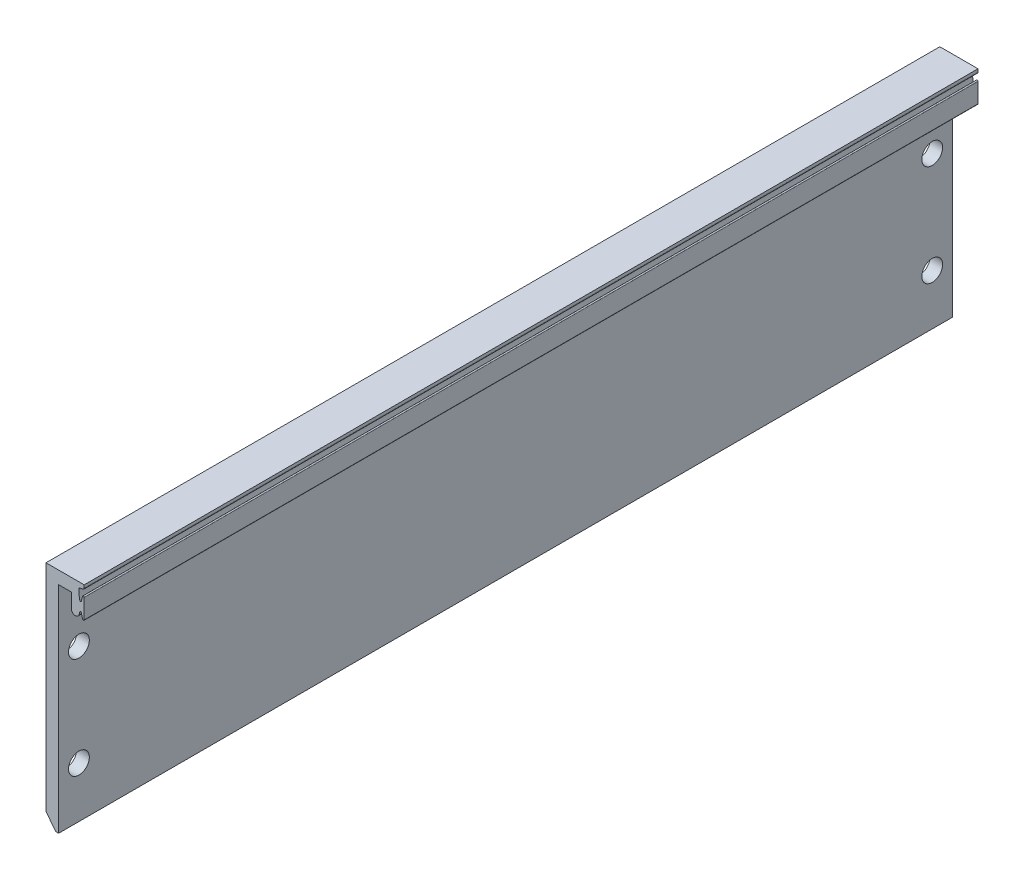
ISO-10303-21;
HEADER;
FILE_DESCRIPTION(('STEP AP214'),'2;1');
FILE_NAME('part.step','',(''),(''),'','','');
FILE_SCHEMA(('AUTOMOTIVE_DESIGN { 1 0 10303 214 1 1 1 1 }'));
ENDSEC;
DATA;
#1=APPLICATION_CONTEXT('core data for automotive mechanical design processes');
#2=APPLICATION_PROTOCOL_DEFINITION('international standard','automotive_design',2000,#1);
#3=PRODUCT_CONTEXT('',#1,'mechanical');
#4=PRODUCT('Part','Part','',(#3));
#5=PRODUCT_RELATED_PRODUCT_CATEGORY('part','',(#4));
#6=PRODUCT_DEFINITION_FORMATION('','',#4);
#7=PRODUCT_DEFINITION_CONTEXT('part definition',#1,'design');
#8=PRODUCT_DEFINITION('design','',#6,#7);
#9=PRODUCT_DEFINITION_SHAPE('','',#8);
#10=(LENGTH_UNIT() NAMED_UNIT(*) SI_UNIT(.MILLI.,.METRE.));
#11=(NAMED_UNIT(*) PLANE_ANGLE_UNIT() SI_UNIT($,.RADIAN.));
#12=(NAMED_UNIT(*) SI_UNIT($,.STERADIAN.) SOLID_ANGLE_UNIT());
#13=UNCERTAINTY_MEASURE_WITH_UNIT(LENGTH_MEASURE(1.E-05),#10,'distance_accuracy_value','');
#14=(GEOMETRIC_REPRESENTATION_CONTEXT(3) GLOBAL_UNCERTAINTY_ASSIGNED_CONTEXT((#13)) GLOBAL_UNIT_ASSIGNED_CONTEXT((#10,
#11,#12)) REPRESENTATION_CONTEXT('',''));
#15=CARTESIAN_POINT('',(0.,0.,0.));
#16=DIRECTION('',(0.,0.,1.));
#17=DIRECTION('',(1.,0.,0.));
#18=AXIS2_PLACEMENT_3D('',#15,#16,#17);
#19=CARTESIAN_POINT('',(540.829442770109,-3340.4171465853,88.225));
#20=DIRECTION('',(-0.159823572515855,0.987145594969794,0.));
#21=DIRECTION('',(-0.987145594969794,-0.159823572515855,0.));
#22=AXIS2_PLACEMENT_3D('',#19,#20,#21);
#23=PLANE('',#22);
#24=DIRECTION('',(0.987145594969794,0.159823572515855,0.));
#25=VECTOR('',#24,1.);
#26=CARTESIAN_POINT('',(540.829442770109,-3340.4171465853,-88.225));
#27=LINE('',#26,#25);
#28=CARTESIAN_POINT('',(2261.93990029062,-3061.76116775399,-88.225));
#29=VERTEX_POINT('',#28);
#30=CARTESIAN_POINT('',(2262.48897943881,-3061.67226922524,-88.225));
#31=VERTEX_POINT('',#30);
#32=EDGE_CURVE('E215',#29,#31,#27,.T.);
#33=ORIENTED_EDGE('',*,*,#32,.T.);
#34=DIRECTION('',(0.,0.,-1.));
#35=VECTOR('',#34,1.);
#36=CARTESIAN_POINT('',(2262.48897943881,-3061.67226922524,88.225));
#37=LINE('',#36,#35);
#38=CARTESIAN_POINT('',(2262.48897943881,-3061.67226922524,88.225));
#39=VERTEX_POINT('',#38);
#40=EDGE_CURVE('E11',#39,#31,#37,.T.);
#41=ORIENTED_EDGE('',*,*,#40,.F.);
#42=DIRECTION('',(0.987145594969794,0.159823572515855,0.));
#43=VECTOR('',#42,1.);
#44=CARTESIAN_POINT('',(540.829442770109,-3340.4171465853,88.225));
#45=LINE('',#44,#43);
#46=CARTESIAN_POINT('',(2261.93990029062,-3061.76116775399,88.225));
#47=VERTEX_POINT('',#46);
#48=EDGE_CURVE('E263',#47,#39,#45,.T.);
#49=ORIENTED_EDGE('',*,*,#48,.F.);
#50=DIRECTION('',(0.,0.,-1.));
#51=VECTOR('',#50,1.);
#52=CARTESIAN_POINT('',(2261.93990029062,-3061.76116775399,88.225));
#53=LINE('',#52,#51);
#54=EDGE_CURVE('E57',#47,#29,#53,.T.);
#55=ORIENTED_EDGE('',*,*,#54,.T.);
#56=EDGE_LOOP('',(#33,#41,#49,#55));
#57=FACE_BOUND('',#56,.T.);
#58=ADVANCED_FACE('F39',(#57),#23,.F.);
#59=CARTESIAN_POINT('',(2262.44103236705,-3061.37612554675,88.225));
#60=DIRECTION('',(0.,0.,-1.));
#61=DIRECTION('',(-1.,0.,0.));
#62=AXIS2_PLACEMENT_3D('',#59,#60,#61);
#63=CYLINDRICAL_SURFACE('',#62,0.300000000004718);
#64=CARTESIAN_POINT('',(2262.44103236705,-3061.37612554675,-88.225));
#65=DIRECTION('',(0.,0.,1.));
#66=DIRECTION('',(1.,0.,0.));
#67=AXIS2_PLACEMENT_3D('',#64,#65,#66);
#68=CIRCLE('',#67,0.300000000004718);
#69=CARTESIAN_POINT('',(2262.74103236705,-3061.37612554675,-88.225));
#70=VERTEX_POINT('',#69);
#71=EDGE_CURVE('E217',#31,#70,#68,.T.);
#72=ORIENTED_EDGE('',*,*,#71,.T.);
#73=DIRECTION('',(0.,0.,-1.));
#74=VECTOR('',#73,1.);
#75=CARTESIAN_POINT('',(2262.74103236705,-3061.37612554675,88.225));
#76=LINE('',#75,#74);
#77=CARTESIAN_POINT('',(2262.74103236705,-3061.37612554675,88.225));
#78=VERTEX_POINT('',#77);
#79=EDGE_CURVE('E48',#78,#70,#76,.T.);
#80=ORIENTED_EDGE('',*,*,#79,.F.);
#81=CARTESIAN_POINT('',(2262.44103236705,-3061.37612554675,88.225));
#82=DIRECTION('',(0.,0.,1.));
#83=DIRECTION('',(1.,0.,0.));
#84=AXIS2_PLACEMENT_3D('',#81,#82,#83);
#85=CIRCLE('',#84,0.300000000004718);
#86=EDGE_CURVE('E134',#39,#78,#85,.T.);
#87=ORIENTED_EDGE('',*,*,#86,.F.);
#88=ORIENTED_EDGE('',*,*,#40,.T.);
#89=EDGE_LOOP('',(#72,#80,#87,#88));
#90=FACE_BOUND('',#89,.T.);
#91=ADVANCED_FACE('F389',(#90),#63,.T.);
#92=CARTESIAN_POINT('',(2262.74103237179,-3.49719947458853E-09,88.225));
#93=DIRECTION('',(1.,-1.54555887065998E-12,0.));
#94=DIRECTION('',(1.54555887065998E-12,1.,0.));
#95=AXIS2_PLACEMENT_3D('',#92,#93,#94);
#96=PLANE('',#95);
#97=DIRECTION('',(-1.54555887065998E-12,-1.,0.));
#98=VECTOR('',#97,1.);
#99=CARTESIAN_POINT('',(2262.74103237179,-3.49719947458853E-09,-88.225));
#100=LINE('',#99,#98);
#101=CARTESIAN_POINT('',(2262.74103236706,-3060.80146065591,-88.225));
#102=VERTEX_POINT('',#101);
#103=EDGE_CURVE('E221',#102,#70,#100,.T.);
#104=ORIENTED_EDGE('',*,*,#103,.F.);
#105=DIRECTION('',(0.,0.,-1.));
#106=VECTOR('',#105,1.);
#107=CARTESIAN_POINT('',(2262.74103236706,-3060.80146065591,88.225));
#108=LINE('',#107,#106);
#109=CARTESIAN_POINT('',(2262.74103236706,-3060.80146065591,88.225));
#110=VERTEX_POINT('',#109);
#111=EDGE_CURVE('E307',#110,#102,#108,.T.);
#112=ORIENTED_EDGE('',*,*,#111,.F.);
#113=DIRECTION('',(-1.54555887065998E-12,-1.,0.));
#114=VECTOR('',#113,1.);
#115=CARTESIAN_POINT('',(2262.74103237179,-3.49719947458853E-09,88.225));
#116=LINE('',#115,#114);
#117=EDGE_CURVE('E335',#110,#78,#116,.T.);
#118=ORIENTED_EDGE('',*,*,#117,.T.);
#119=ORIENTED_EDGE('',*,*,#79,.T.);
#120=EDGE_LOOP('',(#104,#112,#118,#119));
#121=FACE_BOUND('',#120,.T.);
#122=ADVANCED_FACE('F393',(#121),#96,.T.);
#123=CARTESIAN_POINT('',(1.80274390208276E-10,-3060.80146065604,88.225));
#124=DIRECTION('',(0.,-1.,0.));
#125=DIRECTION('',(1.,0.,0.));
#126=AXIS2_PLACEMENT_3D('',#123,#124,#125);
#127=PLANE('',#126);
#128=DIRECTION('',(-1.,0.,0.));
#129=VECTOR('',#128,1.);
#130=CARTESIAN_POINT('',(1.80274390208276E-10,-3060.80146065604,-88.225));
#131=LINE('',#130,#129);
#132=CARTESIAN_POINT('',(2255.20103236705,-3060.80146065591,-88.225));
#133=VERTEX_POINT('',#132);
#134=EDGE_CURVE('E224',#102,#133,#131,.T.);
#135=ORIENTED_EDGE('',*,*,#134,.T.);
#136=DIRECTION('',(0.,0.,-1.));
#137=VECTOR('',#136,1.);
#138=CARTESIAN_POINT('',(2255.20103236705,-3060.80146065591,88.225));
#139=LINE('',#138,#137);
#140=CARTESIAN_POINT('',(2255.20103236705,-3060.80146065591,88.225));
#141=VERTEX_POINT('',#140);
#142=EDGE_CURVE('E304',#141,#133,#139,.T.);
#143=ORIENTED_EDGE('',*,*,#142,.F.);
#144=DIRECTION('',(-1.,0.,0.));
#145=VECTOR('',#144,1.);
#146=CARTESIAN_POINT('',(1.80274390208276E-10,-3060.80146065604,88.225));
#147=LINE('',#146,#145);
#148=EDGE_CURVE('E338',#110,#141,#147,.T.);
#149=ORIENTED_EDGE('',*,*,#148,.F.);
#150=ORIENTED_EDGE('',*,*,#111,.T.);
#151=EDGE_LOOP('',(#135,#143,#149,#150));
#152=FACE_BOUND('',#151,.T.);
#153=ADVANCED_FACE('F405',(#152),#127,.F.);
#154=CARTESIAN_POINT('',(2255.20103236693,9.42598065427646E-11,88.225));
#155=DIRECTION('',(1.,0.,0.));
#156=DIRECTION('',(0.,1.,0.));
#157=AXIS2_PLACEMENT_3D('',#154,#155,#156);
#158=PLANE('',#157);
#159=CARTESIAN_POINT('',(2255.20103236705,-3075.80146065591,84.225));
#160=DIRECTION('',(-1.,0.,0.));
#161=DIRECTION('',(0.,1.,0.));
#162=AXIS2_PLACEMENT_3D('',#159,#160,#161);
#163=CIRCLE('',#162,2.04999999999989);
#164=CARTESIAN_POINT('',(2255.20103236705,-3073.75146065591,84.225));
#165=VERTEX_POINT('',#164);
#166=EDGE_CURVE('E328',#165,#165,#163,.T.);
#167=ORIENTED_EDGE('',*,*,#166,.F.);
#168=EDGE_LOOP('',(#167));
#169=FACE_BOUND('',#168,.T.);
#170=CARTESIAN_POINT('',(2255.20103236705,-3095.80146065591,84.225));
#171=DIRECTION('',(-1.,0.,0.));
#172=DIRECTION('',(0.,1.,0.));
#173=AXIS2_PLACEMENT_3D('',#170,#171,#172);
#174=CIRCLE('',#173,2.04999999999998);
#175=CARTESIAN_POINT('',(2255.20103236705,-3093.75146065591,84.225));
#176=VERTEX_POINT('',#175);
#177=EDGE_CURVE('E318',#176,#176,#174,.T.);
#178=ORIENTED_EDGE('',*,*,#177,.F.);
#179=EDGE_LOOP('',(#178));
#180=FACE_BOUND('',#179,.T.);
#181=CARTESIAN_POINT('',(2255.20103236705,-3095.80146065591,-84.225));
#182=DIRECTION('',(-1.,0.,0.));
#183=DIRECTION('',(0.,-1.,0.));
#184=AXIS2_PLACEMENT_3D('',#181,#182,#183);
#185=CIRCLE('',#184,2.04999999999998);
#186=CARTESIAN_POINT('',(2255.20103236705,-3097.85146065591,-84.225));
#187=VERTEX_POINT('',#186);
#188=EDGE_CURVE('E315',#187,#187,#185,.T.);
#189=ORIENTED_EDGE('',*,*,#188,.F.);
#190=EDGE_LOOP('',(#189));
#191=FACE_BOUND('',#190,.T.);
#192=CARTESIAN_POINT('',(2255.20103236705,-3075.80146065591,-84.225));
#193=DIRECTION('',(-1.,0.,0.));
#194=DIRECTION('',(0.,-1.,0.));
#195=AXIS2_PLACEMENT_3D('',#192,#193,#194);
#196=CIRCLE('',#195,2.04999999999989);
#197=CARTESIAN_POINT('',(2255.20103236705,-3077.85146065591,-84.225));
#198=VERTEX_POINT('',#197);
#199=EDGE_CURVE('E312',#198,#198,#196,.T.);
#200=ORIENTED_EDGE('',*,*,#199,.F.);
#201=EDGE_LOOP('',(#200));
#202=FACE_BOUND('',#201,.T.);
#203=DIRECTION('',(0.,-1.,0.));
#204=VECTOR('',#203,1.);
#205=CARTESIAN_POINT('',(2255.20103236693,9.42598065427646E-11,-88.225));
#206=LINE('',#205,#204);
#207=CARTESIAN_POINT('',(2255.20103236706,-3103.30146065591,-88.225));
#208=VERTEX_POINT('',#207);
#209=EDGE_CURVE('E226',#133,#208,#206,.T.);
#210=ORIENTED_EDGE('',*,*,#209,.T.);
#211=DIRECTION('',(0.,0.,-1.));
#212=VECTOR('',#211,1.);
#213=CARTESIAN_POINT('',(2255.20103236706,-3103.30146065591,88.225));
#214=LINE('',#213,#212);
#215=CARTESIAN_POINT('',(2255.20103236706,-3103.30146065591,88.225));
#216=VERTEX_POINT('',#215);
#217=EDGE_CURVE('E301',#216,#208,#214,.T.);
#218=ORIENTED_EDGE('',*,*,#217,.F.);
#219=DIRECTION('',(0.,-1.,0.));
#220=VECTOR('',#219,1.);
#221=CARTESIAN_POINT('',(2255.20103236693,9.42598065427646E-11,88.225));
#222=LINE('',#221,#220);
#223=EDGE_CURVE('E340',#141,#216,#222,.T.);
#224=ORIENTED_EDGE('',*,*,#223,.F.);
#225=ORIENTED_EDGE('',*,*,#142,.T.);
#226=EDGE_LOOP('',(#210,#218,#224,#225));
#227=FACE_BOUND('',#226,.T.);
#228=ADVANCED_FACE('F407',(#169,#180,#191,#202,#227),#158,.F.);
#229=CARTESIAN_POINT('',(-65.4843291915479,-49.7680901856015,88.225));
#230=DIRECTION('',(0.796162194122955,0.605083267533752,0.));
#231=DIRECTION('',(-0.605083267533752,0.796162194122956,0.));
#232=AXIS2_PLACEMENT_3D('',#229,#230,#231);
#233=PLANE('',#232);
#234=DIRECTION('',(0.605083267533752,-0.796162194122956,0.));
#235=VECTOR('',#234,1.);
#236=CARTESIAN_POINT('',(-65.4843291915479,-49.7680901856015,-88.225));
#237=LINE('',#236,#235);
#238=CARTESIAN_POINT('',(2257.10103236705,-3105.8014606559,-88.225));
#239=VERTEX_POINT('',#238);
#240=EDGE_CURVE('E228',#208,#239,#237,.T.);
#241=ORIENTED_EDGE('',*,*,#240,.T.);
#242=DIRECTION('',(0.,0.,-1.));
#243=VECTOR('',#242,1.);
#244=CARTESIAN_POINT('',(2257.10103236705,-3105.8014606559,88.225));
#245=LINE('',#244,#243);
#246=CARTESIAN_POINT('',(2257.10103236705,-3105.8014606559,88.225));
#247=VERTEX_POINT('',#246);
#248=EDGE_CURVE('E298',#247,#239,#245,.T.);
#249=ORIENTED_EDGE('',*,*,#248,.F.);
#250=DIRECTION('',(0.605083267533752,-0.796162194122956,0.));
#251=VECTOR('',#250,1.);
#252=CARTESIAN_POINT('',(-65.4843291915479,-49.7680901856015,88.225));
#253=LINE('',#252,#251);
#254=EDGE_CURVE('E342',#216,#247,#253,.T.);
#255=ORIENTED_EDGE('',*,*,#254,.F.);
#256=ORIENTED_EDGE('',*,*,#217,.T.);
#257=EDGE_LOOP('',(#241,#249,#255,#256));
#258=FACE_BOUND('',#257,.T.);
#259=ADVANCED_FACE('F412',(#258),#233,.F.);
#260=CARTESIAN_POINT('',(0.,-3105.8014606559,88.225));
#261=DIRECTION('',(0.,1.,0.));
#262=DIRECTION('',(0.,0.,1.));
#263=AXIS2_PLACEMENT_3D('',#260,#261,#262);
#264=PLANE('',#263);
#265=DIRECTION('',(1.,0.,0.));
#266=VECTOR('',#265,1.);
#267=CARTESIAN_POINT('',(0.,-3105.8014606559,-88.225));
#268=LINE('',#267,#266);
#269=CARTESIAN_POINT('',(2257.70103236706,-3105.8014606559,-88.225));
#270=VERTEX_POINT('',#269);
#271=EDGE_CURVE('E230',#239,#270,#268,.T.);
#272=ORIENTED_EDGE('',*,*,#271,.T.);
#273=DIRECTION('',(0.,0.,-1.));
#274=VECTOR('',#273,1.);
#275=CARTESIAN_POINT('',(2257.70103236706,-3105.8014606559,88.225));
#276=LINE('',#275,#274);
#277=CARTESIAN_POINT('',(2257.70103236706,-3105.8014606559,88.225));
#278=VERTEX_POINT('',#277);
#279=EDGE_CURVE('E295',#278,#270,#276,.T.);
#280=ORIENTED_EDGE('',*,*,#279,.F.);
#281=DIRECTION('',(1.,0.,0.));
#282=VECTOR('',#281,1.);
#283=CARTESIAN_POINT('',(0.,-3105.8014606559,88.225));
#284=LINE('',#283,#282);
#285=EDGE_CURVE('E344',#247,#278,#284,.T.);
#286=ORIENTED_EDGE('',*,*,#285,.F.);
#287=ORIENTED_EDGE('',*,*,#248,.T.);
#288=EDGE_LOOP('',(#272,#280,#286,#287));
#289=FACE_BOUND('',#288,.T.);
#290=ADVANCED_FACE('F418',(#289),#264,.F.);
#291=CARTESIAN_POINT('',(2257.70103236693,9.43642981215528E-11,88.225));
#292=DIRECTION('',(-1.,0.,0.));
#293=DIRECTION('',(0.,-1.,0.));
#294=AXIS2_PLACEMENT_3D('',#291,#292,#293);
#295=PLANE('',#294);
#296=CARTESIAN_POINT('',(2257.70103236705,-3075.80146065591,84.225));
#297=DIRECTION('',(-1.,0.,0.));
#298=DIRECTION('',(0.,-1.,0.));
#299=AXIS2_PLACEMENT_3D('',#296,#297,#298);
#300=CIRCLE('',#299,2.04999999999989);
#301=CARTESIAN_POINT('',(2257.70103236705,-3077.85146065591,84.225));
#302=VERTEX_POINT('',#301);
#303=EDGE_CURVE('E42',#302,#302,#300,.T.);
#304=ORIENTED_EDGE('',*,*,#303,.T.);
#305=EDGE_LOOP('',(#304));
#306=FACE_BOUND('',#305,.T.);
#307=CARTESIAN_POINT('',(2257.70103236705,-3095.80146065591,84.225));
#308=DIRECTION('',(-1.,0.,0.));
#309=DIRECTION('',(0.,-1.,0.));
#310=AXIS2_PLACEMENT_3D('',#307,#308,#309);
#311=CIRCLE('',#310,2.04999999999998);
#312=CARTESIAN_POINT('',(2257.70103236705,-3097.85146065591,84.225));
#313=VERTEX_POINT('',#312);
#314=EDGE_CURVE('E316',#313,#313,#311,.T.);
#315=ORIENTED_EDGE('',*,*,#314,.T.);
#316=EDGE_LOOP('',(#315));
#317=FACE_BOUND('',#316,.T.);
#318=CARTESIAN_POINT('',(2257.70103236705,-3095.80146065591,-84.225));
#319=DIRECTION('',(-1.,0.,0.));
#320=DIRECTION('',(0.,-1.,0.));
#321=AXIS2_PLACEMENT_3D('',#318,#319,#320);
#322=CIRCLE('',#321,2.04999999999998);
#323=CARTESIAN_POINT('',(2257.70103236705,-3097.85146065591,-84.225));
#324=VERTEX_POINT('',#323);
#325=EDGE_CURVE('E313',#324,#324,#322,.T.);
#326=ORIENTED_EDGE('',*,*,#325,.T.);
#327=EDGE_LOOP('',(#326));
#328=FACE_BOUND('',#327,.T.);
#329=CARTESIAN_POINT('',(2257.70103236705,-3075.80146065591,-84.225));
#330=DIRECTION('',(-1.,0.,0.));
#331=DIRECTION('',(0.,-1.,0.));
#332=AXIS2_PLACEMENT_3D('',#329,#330,#331);
#333=CIRCLE('',#332,2.04999999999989);
#334=CARTESIAN_POINT('',(2257.70103236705,-3077.85146065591,-84.225));
#335=VERTEX_POINT('',#334);
#336=EDGE_CURVE('E218',#335,#335,#333,.T.);
#337=ORIENTED_EDGE('',*,*,#336,.T.);
#338=EDGE_LOOP('',(#337));
#339=FACE_BOUND('',#338,.T.);
#340=DIRECTION('',(0.,1.,0.));
#341=VECTOR('',#340,1.);
#342=CARTESIAN_POINT('',(2257.70103236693,9.43642981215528E-11,-88.225));
#343=LINE('',#342,#341);
#344=CARTESIAN_POINT('',(2257.70103236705,-3063.3014606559,-88.225));
#345=VERTEX_POINT('',#344);
#346=EDGE_CURVE('E232',#270,#345,#343,.T.);
#347=ORIENTED_EDGE('',*,*,#346,.T.);
#348=DIRECTION('',(0.,0.,-1.));
#349=VECTOR('',#348,1.);
#350=CARTESIAN_POINT('',(2257.70103236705,-3063.3014606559,88.225));
#351=LINE('',#350,#349);
#352=CARTESIAN_POINT('',(2257.70103236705,-3063.3014606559,88.225));
#353=VERTEX_POINT('',#352);
#354=EDGE_CURVE('E292',#353,#345,#351,.T.);
#355=ORIENTED_EDGE('',*,*,#354,.F.);
#356=DIRECTION('',(0.,1.,0.));
#357=VECTOR('',#356,1.);
#358=CARTESIAN_POINT('',(2257.70103236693,9.43642981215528E-11,88.225));
#359=LINE('',#358,#357);
#360=EDGE_CURVE('E346',#278,#353,#359,.T.);
#361=ORIENTED_EDGE('',*,*,#360,.F.);
#362=ORIENTED_EDGE('',*,*,#279,.T.);
#363=EDGE_LOOP('',(#347,#355,#361,#362));
#364=FACE_BOUND('',#363,.T.);
#365=ADVANCED_FACE('F422',(#306,#317,#328,#339,#364),#295,.F.);
#366=CARTESIAN_POINT('',(-5.44151650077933E-10,-3063.3014606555,88.225));
#367=DIRECTION('',(1.77635683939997E-13,1.,0.));
#368=DIRECTION('',(-1.,1.77635683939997E-13,0.));
#369=AXIS2_PLACEMENT_3D('',#366,#367,#368);
#370=PLANE('',#369);
#371=DIRECTION('',(1.,-1.77635683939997E-13,0.));
#372=VECTOR('',#371,1.);
#373=CARTESIAN_POINT('',(-5.44151650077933E-10,-3063.3014606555,-88.225));
#374=LINE('',#373,#372);
#375=CARTESIAN_POINT('',(2260.20103236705,-3063.3014606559,-88.225));
#376=VERTEX_POINT('',#375);
#377=EDGE_CURVE('E234',#345,#376,#374,.T.);
#378=ORIENTED_EDGE('',*,*,#377,.T.);
#379=DIRECTION('',(0.,0.,-1.));
#380=VECTOR('',#379,1.);
#381=CARTESIAN_POINT('',(2260.20103236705,-3063.3014606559,88.225));
#382=LINE('',#381,#380);
#383=CARTESIAN_POINT('',(2260.20103236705,-3063.3014606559,88.225));
#384=VERTEX_POINT('',#383);
#385=EDGE_CURVE('E289',#384,#376,#382,.T.);
#386=ORIENTED_EDGE('',*,*,#385,.F.);
#387=DIRECTION('',(1.,-1.77635683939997E-13,0.));
#388=VECTOR('',#387,1.);
#389=CARTESIAN_POINT('',(-5.44151650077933E-10,-3063.3014606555,88.225));
#390=LINE('',#389,#388);
#391=EDGE_CURVE('E348',#353,#384,#390,.T.);
#392=ORIENTED_EDGE('',*,*,#391,.F.);
#393=ORIENTED_EDGE('',*,*,#354,.T.);
#394=EDGE_LOOP('',(#378,#386,#392,#393));
#395=FACE_BOUND('',#394,.T.);
#396=ADVANCED_FACE('F427',(#395),#370,.F.);
#397=CARTESIAN_POINT('',(2260.2010323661,7.00369407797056E-10,88.225));
#398=DIRECTION('',(1.,3.09870404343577E-13,0.));
#399=DIRECTION('',(-3.09870404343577E-13,1.,0.));
#400=AXIS2_PLACEMENT_3D('',#397,#398,#399);
#401=PLANE('',#400);
#402=DIRECTION('',(3.09870404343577E-13,-1.,0.));
#403=VECTOR('',#402,1.);
#404=CARTESIAN_POINT('',(2260.2010323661,7.00369407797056E-10,-88.225));
#405=LINE('',#404,#403);
#406=CARTESIAN_POINT('',(2260.20103236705,-3066.16775058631,-88.225));
#407=VERTEX_POINT('',#406);
#408=EDGE_CURVE('E236',#376,#407,#405,.T.);
#409=ORIENTED_EDGE('',*,*,#408,.T.);
#410=DIRECTION('',(0.,0.,-1.));
#411=VECTOR('',#410,1.);
#412=CARTESIAN_POINT('',(2260.20103236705,-3066.16775058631,88.225));
#413=LINE('',#412,#411);
#414=CARTESIAN_POINT('',(2260.20103236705,-3066.16775058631,88.225));
#415=VERTEX_POINT('',#414);
#416=EDGE_CURVE('E286',#415,#407,#413,.T.);
#417=ORIENTED_EDGE('',*,*,#416,.F.);
#418=DIRECTION('',(3.09870404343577E-13,-1.,0.));
#419=VECTOR('',#418,1.);
#420=CARTESIAN_POINT('',(2260.2010323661,7.00369407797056E-10,88.225));
#421=LINE('',#420,#419);
#422=EDGE_CURVE('E350',#384,#415,#421,.T.);
#423=ORIENTED_EDGE('',*,*,#422,.F.);
#424=ORIENTED_EDGE('',*,*,#385,.T.);
#425=EDGE_LOOP('',(#409,#417,#423,#424));
#426=FACE_BOUND('',#425,.T.);
#427=ADVANCED_FACE('F433',(#426),#401,.F.);
#428=CARTESIAN_POINT('',(2260.98474243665,-3066.16775058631,88.225));
#429=DIRECTION('',(0.,0.,-1.));
#430=DIRECTION('',(-1.,0.,0.));
#431=AXIS2_PLACEMENT_3D('',#428,#429,#430);
#432=CYLINDRICAL_SURFACE('',#431,0.783710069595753);
#433=CARTESIAN_POINT('',(2260.98474243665,-3066.16775058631,-88.225));
#434=DIRECTION('',(0.,0.,1.));
#435=DIRECTION('',(1.,0.,0.));
#436=AXIS2_PLACEMENT_3D('',#433,#434,#435);
#437=CIRCLE('',#436,0.783710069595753);
#438=CARTESIAN_POINT('',(2261.74118201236,-3066.37269116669,-88.225));
#439=VERTEX_POINT('',#438);
#440=EDGE_CURVE('E238',#407,#439,#437,.T.);
#441=ORIENTED_EDGE('',*,*,#440,.T.);
#442=DIRECTION('',(0.,0.,-1.));
#443=VECTOR('',#442,1.);
#444=CARTESIAN_POINT('',(2261.74118201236,-3066.37269116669,88.225));
#445=LINE('',#444,#443);
#446=CARTESIAN_POINT('',(2261.74118201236,-3066.37269116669,88.225));
#447=VERTEX_POINT('',#446);
#448=EDGE_CURVE('E283',#447,#439,#445,.T.);
#449=ORIENTED_EDGE('',*,*,#448,.F.);
#450=CARTESIAN_POINT('',(2260.98474243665,-3066.16775058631,88.225));
#451=DIRECTION('',(0.,0.,1.));
#452=DIRECTION('',(1.,0.,0.));
#453=AXIS2_PLACEMENT_3D('',#450,#451,#452);
#454=CIRCLE('',#453,0.783710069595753);
#455=EDGE_CURVE('E352',#415,#447,#454,.T.);
#456=ORIENTED_EDGE('',*,*,#455,.F.);
#457=ORIENTED_EDGE('',*,*,#416,.T.);
#458=EDGE_LOOP('',(#441,#449,#456,#457));
#459=FACE_BOUND('',#458,.T.);
#460=ADVANCED_FACE('F437',(#459),#432,.T.);
#461=CARTESIAN_POINT('',(2881.03366264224,-780.552379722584,88.225));
#462=DIRECTION('',(-0.965203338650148,0.261500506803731,0.));
#463=DIRECTION('',(-0.261500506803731,-0.965203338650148,0.));
#464=AXIS2_PLACEMENT_3D('',#461,#462,#463);
#465=PLANE('',#464);
#466=DIRECTION('',(0.261500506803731,0.965203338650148,0.));
#467=VECTOR('',#466,1.);
#468=CARTESIAN_POINT('',(2881.03366264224,-780.552379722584,-88.225));
#469=LINE('',#468,#467);
#470=CARTESIAN_POINT('',(2261.88625186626,-3065.83723557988,-88.225));
#471=VERTEX_POINT('',#470);
#472=EDGE_CURVE('E240',#439,#471,#469,.T.);
#473=ORIENTED_EDGE('',*,*,#472,.T.);
#474=DIRECTION('',(0.,0.,-1.));
#475=VECTOR('',#474,1.);
#476=CARTESIAN_POINT('',(2261.88625186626,-3065.83723557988,88.225));
#477=LINE('',#476,#475);
#478=CARTESIAN_POINT('',(2261.88625186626,-3065.83723557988,88.225));
#479=VERTEX_POINT('',#478);
#480=EDGE_CURVE('E281',#479,#471,#477,.T.);
#481=ORIENTED_EDGE('',*,*,#480,.F.);
#482=DIRECTION('',(0.261500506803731,0.965203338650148,0.));
#483=VECTOR('',#482,1.);
#484=CARTESIAN_POINT('',(2881.03366264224,-780.552379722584,88.225));
#485=LINE('',#484,#483);
#486=EDGE_CURVE('E354',#447,#479,#485,.T.);
#487=ORIENTED_EDGE('',*,*,#486,.F.);
#488=ORIENTED_EDGE('',*,*,#448,.T.);
#489=EDGE_LOOP('',(#473,#481,#487,#488));
#490=FACE_BOUND('',#489,.T.);
#491=ADVANCED_FACE('F442',(#490),#465,.F.);
#492=CARTESIAN_POINT('',(2262.03103236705,-3065.8764606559,88.225));
#493=DIRECTION('',(0.,0.,-1.));
#494=DIRECTION('',(-1.,0.,0.));
#495=AXIS2_PLACEMENT_3D('',#492,#493,#494);
#496=CYLINDRICAL_SURFACE('',#495,0.149999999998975);
#497=CARTESIAN_POINT('',(2262.03103236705,-3065.8764606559,-88.225));
#498=DIRECTION('',(0.,0.,1.));
#499=DIRECTION('',(1.,0.,0.));
#500=AXIS2_PLACEMENT_3D('',#497,#498,#499);
#501=CIRCLE('',#500,0.149999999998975);
#502=CARTESIAN_POINT('',(2262.1766483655,-3065.84046091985,-88.225));
#503=VERTEX_POINT('',#502);
#504=EDGE_CURVE('E243',#503,#471,#501,.T.);
#505=ORIENTED_EDGE('',*,*,#504,.F.);
#506=DIRECTION('',(0.,0.,-1.));
#507=VECTOR('',#506,1.);
#508=CARTESIAN_POINT('',(2262.1766483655,-3065.84046091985,88.225));
#509=LINE('',#508,#507);
#510=CARTESIAN_POINT('',(2262.1766483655,-3065.84046091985,88.225));
#511=VERTEX_POINT('',#510);
#512=EDGE_CURVE('E279',#511,#503,#509,.T.);
#513=ORIENTED_EDGE('',*,*,#512,.F.);
#514=CARTESIAN_POINT('',(2262.03103236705,-3065.8764606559,88.225));
#515=DIRECTION('',(0.,0.,1.));
#516=DIRECTION('',(1.,0.,0.));
#517=AXIS2_PLACEMENT_3D('',#514,#515,#516);
#518=CIRCLE('',#517,0.149999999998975);
#519=EDGE_CURVE('E356',#511,#479,#518,.T.);
#520=ORIENTED_EDGE('',*,*,#519,.T.);
#521=ORIENTED_EDGE('',*,*,#480,.T.);
#522=EDGE_LOOP('',(#505,#513,#520,#521));
#523=FACE_BOUND('',#522,.T.);
#524=ADVANCED_FACE('F448',(#523),#496,.F.);
#525=CARTESIAN_POINT('',(1417.58574950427,350.460892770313,88.225));
#526=DIRECTION('',(0.970773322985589,0.239998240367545,0.));
#527=DIRECTION('',(-0.239998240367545,0.970773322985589,0.));
#528=AXIS2_PLACEMENT_3D('',#525,#526,#527);
#529=PLANE('',#528);
#530=DIRECTION('',(0.239998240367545,-0.970773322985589,0.));
#531=VECTOR('',#530,1.);
#532=CARTESIAN_POINT('',(1417.58574950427,350.460892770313,-88.225));
#533=LINE('',#532,#531);
#534=CARTESIAN_POINT('',(2262.42078170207,-3066.82796036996,-88.225));
#535=VERTEX_POINT('',#534);
#536=EDGE_CURVE('E246',#503,#535,#533,.T.);
#537=ORIENTED_EDGE('',*,*,#536,.T.);
#538=DIRECTION('',(0.,0.,-1.));
#539=VECTOR('',#538,1.);
#540=CARTESIAN_POINT('',(2262.42078170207,-3066.82796036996,88.225));
#541=LINE('',#540,#539);
#542=CARTESIAN_POINT('',(2262.42078170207,-3066.82796036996,88.225));
#543=VERTEX_POINT('',#542);
#544=EDGE_CURVE('E276',#543,#535,#541,.T.);
#545=ORIENTED_EDGE('',*,*,#544,.F.);
#546=DIRECTION('',(0.239998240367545,-0.970773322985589,0.));
#547=VECTOR('',#546,1.);
#548=CARTESIAN_POINT('',(1417.58574950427,350.460892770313,88.225));
#549=LINE('',#548,#547);
#550=EDGE_CURVE('E359',#511,#543,#549,.T.);
#551=ORIENTED_EDGE('',*,*,#550,.F.);
#552=ORIENTED_EDGE('',*,*,#512,.T.);
#553=EDGE_LOOP('',(#537,#545,#551,#552));
#554=FACE_BOUND('',#553,.T.);
#555=ADVANCED_FACE('F451',(#554),#529,.F.);
#556=CARTESIAN_POINT('',(2262.57853236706,-3066.7889606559,88.225));
#557=DIRECTION('',(0.,0.,-1.));
#558=DIRECTION('',(-1.,0.,0.));
#559=AXIS2_PLACEMENT_3D('',#556,#557,#558);
#560=CYLINDRICAL_SURFACE('',#559,0.162500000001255);
#561=CARTESIAN_POINT('',(2262.57853236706,-3066.7889606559,-88.225));
#562=DIRECTION('',(0.,0.,1.));
#563=DIRECTION('',(1.,0.,0.));
#564=AXIS2_PLACEMENT_3D('',#561,#562,#563);
#565=CIRCLE('',#564,0.162500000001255);
#566=CARTESIAN_POINT('',(2262.74103236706,-3066.78896065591,-88.225));
#567=VERTEX_POINT('',#566);
#568=EDGE_CURVE('E248',#535,#567,#565,.T.);
#569=ORIENTED_EDGE('',*,*,#568,.T.);
#570=DIRECTION('',(0.,0.,-1.));
#571=VECTOR('',#570,1.);
#572=CARTESIAN_POINT('',(2262.74103236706,-3066.78896065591,88.225));
#573=LINE('',#572,#571);
#574=CARTESIAN_POINT('',(2262.74103236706,-3066.78896065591,88.225));
#575=VERTEX_POINT('',#574);
#576=EDGE_CURVE('E273',#575,#567,#573,.T.);
#577=ORIENTED_EDGE('',*,*,#576,.F.);
#578=CARTESIAN_POINT('',(2262.57853236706,-3066.7889606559,88.225));
#579=DIRECTION('',(0.,0.,1.));
#580=DIRECTION('',(1.,0.,0.));
#581=AXIS2_PLACEMENT_3D('',#578,#579,#580);
#582=CIRCLE('',#581,0.162500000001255);
#583=EDGE_CURVE('E361',#543,#575,#582,.T.);
#584=ORIENTED_EDGE('',*,*,#583,.F.);
#585=ORIENTED_EDGE('',*,*,#544,.T.);
#586=EDGE_LOOP('',(#569,#577,#584,#585));
#587=FACE_BOUND('',#586,.T.);
#588=ADVANCED_FACE('F456',(#587),#560,.T.);
#589=CARTESIAN_POINT('',(2262.74103236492,1.57624921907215E-09,88.225));
#590=DIRECTION('',(-1.,-6.96610525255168E-13,0.));
#591=DIRECTION('',(6.96610525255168E-13,-1.,0.));
#592=AXIS2_PLACEMENT_3D('',#589,#590,#591);
#593=PLANE('',#592);
#594=DIRECTION('',(-6.96610525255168E-13,1.,0.));
#595=VECTOR('',#594,1.);
#596=CARTESIAN_POINT('',(2262.74103236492,1.57624921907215E-09,-88.225));
#597=LINE('',#596,#595);
#598=CARTESIAN_POINT('',(2262.74103236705,-3062.96396065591,-88.225));
#599=VERTEX_POINT('',#598);
#600=EDGE_CURVE('E250',#567,#599,#597,.T.);
#601=ORIENTED_EDGE('',*,*,#600,.T.);
#602=DIRECTION('',(0.,0.,-1.));
#603=VECTOR('',#602,1.);
#604=CARTESIAN_POINT('',(2262.74103236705,-3062.96396065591,88.225));
#605=LINE('',#604,#603);
#606=CARTESIAN_POINT('',(2262.74103236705,-3062.96396065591,88.225));
#607=VERTEX_POINT('',#606);
#608=EDGE_CURVE('E270',#607,#599,#605,.T.);
#609=ORIENTED_EDGE('',*,*,#608,.F.);
#610=DIRECTION('',(-6.96610525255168E-13,1.,0.));
#611=VECTOR('',#610,1.);
#612=CARTESIAN_POINT('',(2262.74103236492,1.57624921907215E-09,88.225));
#613=LINE('',#612,#611);
#614=EDGE_CURVE('E363',#575,#607,#613,.T.);
#615=ORIENTED_EDGE('',*,*,#614,.F.);
#616=ORIENTED_EDGE('',*,*,#576,.T.);
#617=EDGE_LOOP('',(#601,#609,#615,#616));
#618=FACE_BOUND('',#617,.T.);
#619=ADVANCED_FACE('F459',(#618),#593,.F.);
#620=CARTESIAN_POINT('',(2262.57853236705,-3062.96396065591,88.225));
#621=DIRECTION('',(0.,0.,-1.));
#622=DIRECTION('',(-1.,0.,0.));
#623=AXIS2_PLACEMENT_3D('',#620,#621,#622);
#624=CYLINDRICAL_SURFACE('',#623,0.162499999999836);
#625=CARTESIAN_POINT('',(2262.57853236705,-3062.96396065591,-88.225));
#626=DIRECTION('',(0.,0.,1.));
#627=DIRECTION('',(1.,0.,0.));
#628=AXIS2_PLACEMENT_3D('',#625,#626,#627);
#629=CIRCLE('',#628,0.162499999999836);
#630=CARTESIAN_POINT('',(2262.42078170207,-3062.92496094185,-88.225));
#631=VERTEX_POINT('',#630);
#632=EDGE_CURVE('E252',#599,#631,#629,.T.);
#633=ORIENTED_EDGE('',*,*,#632,.T.);
#634=DIRECTION('',(0.,0.,-1.));
#635=VECTOR('',#634,1.);
#636=CARTESIAN_POINT('',(2262.42078170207,-3062.92496094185,88.225));
#637=LINE('',#636,#635);
#638=CARTESIAN_POINT('',(2262.42078170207,-3062.92496094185,88.225));
#639=VERTEX_POINT('',#638);
#640=EDGE_CURVE('E267',#639,#631,#637,.T.);
#641=ORIENTED_EDGE('',*,*,#640,.F.);
#642=CARTESIAN_POINT('',(2262.57853236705,-3062.96396065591,88.225));
#643=DIRECTION('',(0.,0.,1.));
#644=DIRECTION('',(1.,0.,0.));
#645=AXIS2_PLACEMENT_3D('',#642,#643,#644);
#646=CIRCLE('',#645,0.162499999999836);
#647=EDGE_CURVE('E365',#607,#639,#646,.T.);
#648=ORIENTED_EDGE('',*,*,#647,.F.);
#649=ORIENTED_EDGE('',*,*,#608,.T.);
#650=EDGE_LOOP('',(#633,#641,#648,#649));
#651=FACE_BOUND('',#650,.T.);
#652=ADVANCED_FACE('F371',(#651),#624,.T.);
#653=CARTESIAN_POINT('',(2845.71942563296,-703.529483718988,88.225));
#654=DIRECTION('',(0.97077332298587,-0.239998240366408,0.));
#655=DIRECTION('',(0.239998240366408,0.97077332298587,0.));
#656=AXIS2_PLACEMENT_3D('',#653,#654,#655);
#657=PLANE('',#656);
#658=DIRECTION('',(-0.239998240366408,-0.97077332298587,0.));
#659=VECTOR('',#658,1.);
#660=CARTESIAN_POINT('',(2845.71942563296,-703.529483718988,-88.225));
#661=LINE('',#660,#659);
#662=CARTESIAN_POINT('',(2262.1766483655,-3063.91246039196,-88.225));
#663=VERTEX_POINT('',#662);
#664=EDGE_CURVE('E254',#631,#663,#661,.T.);
#665=ORIENTED_EDGE('',*,*,#664,.T.);
#666=DIRECTION('',(0.,0.,-1.));
#667=VECTOR('',#666,1.);
#668=CARTESIAN_POINT('',(2262.1766483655,-3063.91246039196,88.225));
#669=LINE('',#668,#667);
#670=CARTESIAN_POINT('',(2262.1766483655,-3063.91246039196,88.225));
#671=VERTEX_POINT('',#670);
#672=EDGE_CURVE('E198',#671,#663,#669,.T.);
#673=ORIENTED_EDGE('',*,*,#672,.F.);
#674=DIRECTION('',(-0.239998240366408,-0.97077332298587,0.));
#675=VECTOR('',#674,1.);
#676=CARTESIAN_POINT('',(2845.71942563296,-703.529483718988,88.225));
#677=LINE('',#676,#675);
#678=EDGE_CURVE('E206',#639,#671,#677,.T.);
#679=ORIENTED_EDGE('',*,*,#678,.F.);
#680=ORIENTED_EDGE('',*,*,#640,.T.);
#681=EDGE_LOOP('',(#665,#673,#679,#680));
#682=FACE_BOUND('',#681,.T.);
#683=ADVANCED_FACE('F375',(#682),#657,.F.);
#684=CARTESIAN_POINT('',(2262.03103236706,-3063.8764606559,88.225));
#685=DIRECTION('',(0.,0.,-1.));
#686=DIRECTION('',(-1.,0.,0.));
#687=AXIS2_PLACEMENT_3D('',#684,#685,#686);
#688=CYLINDRICAL_SURFACE('',#687,0.15000000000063);
#689=CARTESIAN_POINT('',(2262.03103236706,-3063.8764606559,-88.225));
#690=DIRECTION('',(0.,0.,1.));
#691=DIRECTION('',(1.,0.,0.));
#692=AXIS2_PLACEMENT_3D('',#689,#690,#691);
#693=CIRCLE('',#692,0.15000000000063);
#694=CARTESIAN_POINT('',(2261.88205602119,-3063.89395489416,-88.225));
#695=VERTEX_POINT('',#694);
#696=EDGE_CURVE('E194',#695,#663,#693,.T.);
#697=ORIENTED_EDGE('',*,*,#696,.F.);
#698=DIRECTION('',(0.,0.,-1.));
#699=VECTOR('',#698,1.);
#700=CARTESIAN_POINT('',(2261.88205602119,-3063.89395489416,88.225));
#701=LINE('',#700,#699);
#702=CARTESIAN_POINT('',(2261.88205602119,-3063.89395489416,88.225));
#703=VERTEX_POINT('',#702);
#704=EDGE_CURVE('E189',#703,#695,#701,.T.);
#705=ORIENTED_EDGE('',*,*,#704,.F.);
#706=CARTESIAN_POINT('',(2262.03103236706,-3063.8764606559,88.225));
#707=DIRECTION('',(0.,0.,1.));
#708=DIRECTION('',(1.,0.,0.));
#709=AXIS2_PLACEMENT_3D('',#706,#707,#708);
#710=CIRCLE('',#709,0.15000000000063);
#711=EDGE_CURVE('E192',#703,#671,#710,.T.);
#712=ORIENTED_EDGE('',*,*,#711,.T.);
#713=ORIENTED_EDGE('',*,*,#672,.T.);
#714=EDGE_LOOP('',(#697,#705,#712,#713));
#715=FACE_BOUND('',#714,.T.);
#716=ADVANCED_FACE('F191',(#715),#688,.F.);
#717=CARTESIAN_POINT('',(2268.12911712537,-3062.303985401,88.225));
#718=DIRECTION('',(0.,0.,-1.));
#719=DIRECTION('',(-1.,0.,0.));
#720=AXIS2_PLACEMENT_3D('',#717,#718,#719);
#721=CYLINDRICAL_SURFACE('',#720,6.44622179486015);
#722=CARTESIAN_POINT('',(2268.12911712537,-3062.303985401,-88.225));
#723=DIRECTION('',(0.,0.,1.));
#724=DIRECTION('',(1.,0.,0.));
#725=AXIS2_PLACEMENT_3D('',#722,#723,#724);
#726=CIRCLE('',#725,6.44622179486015);
#727=CARTESIAN_POINT('',(2261.68808907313,-3062.04527115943,-88.225));
#728=VERTEX_POINT('',#727);
#729=EDGE_CURVE('E258',#728,#695,#726,.T.);
#730=ORIENTED_EDGE('',*,*,#729,.F.);
#731=DIRECTION('',(0.,0.,-1.));
#732=VECTOR('',#731,1.);
#733=CARTESIAN_POINT('',(2261.68808907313,-3062.04527115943,88.225));
#734=LINE('',#733,#732);
#735=CARTESIAN_POINT('',(2261.68808907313,-3062.04527115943,88.225));
#736=VERTEX_POINT('',#735);
#737=EDGE_CURVE('E122',#736,#728,#734,.T.);
#738=ORIENTED_EDGE('',*,*,#737,.F.);
#739=CARTESIAN_POINT('',(2268.12911712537,-3062.303985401,88.225));
#740=DIRECTION('',(0.,0.,1.));
#741=DIRECTION('',(1.,0.,0.));
#742=AXIS2_PLACEMENT_3D('',#739,#740,#741);
#743=CIRCLE('',#742,6.44622179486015);
#744=EDGE_CURVE('E204',#736,#703,#743,.T.);
#745=ORIENTED_EDGE('',*,*,#744,.T.);
#746=ORIENTED_EDGE('',*,*,#704,.T.);
#747=EDGE_LOOP('',(#730,#738,#745,#746));
#748=FACE_BOUND('',#747,.T.);
#749=ADVANCED_FACE('F209',(#748),#721,.F.);
#750=CARTESIAN_POINT('',(2261.98784736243,-3062.05731143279,88.225));
#751=DIRECTION('',(0.,0.,-1.));
#752=DIRECTION('',(-1.,0.,0.));
#753=AXIS2_PLACEMENT_3D('',#750,#751,#752);
#754=CYLINDRICAL_SURFACE('',#753,0.300000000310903);
#755=CARTESIAN_POINT('',(2261.98784736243,-3062.05731143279,-88.225));
#756=DIRECTION('',(0.,0.,1.));
#757=DIRECTION('',(1.,0.,0.));
#758=AXIS2_PLACEMENT_3D('',#755,#756,#757);
#759=CIRCLE('',#758,0.300000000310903);
#760=EDGE_CURVE('E260',#29,#728,#759,.T.);
#761=ORIENTED_EDGE('',*,*,#760,.F.);
#762=ORIENTED_EDGE('',*,*,#54,.F.);
#763=CARTESIAN_POINT('',(2261.98784736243,-3062.05731143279,88.225));
#764=DIRECTION('',(0.,0.,1.));
#765=DIRECTION('',(1.,0.,0.));
#766=AXIS2_PLACEMENT_3D('',#763,#764,#765);
#767=CIRCLE('',#766,0.300000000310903);
#768=EDGE_CURVE('E210',#47,#736,#767,.T.);
#769=ORIENTED_EDGE('',*,*,#768,.T.);
#770=ORIENTED_EDGE('',*,*,#737,.T.);
#771=EDGE_LOOP('',(#761,#762,#769,#770));
#772=FACE_BOUND('',#771,.T.);
#773=ADVANCED_FACE('F378',(#772),#754,.F.);
#774=CARTESIAN_POINT('',(0.,0.,88.225));
#775=DIRECTION('',(0.,0.,1.));
#776=DIRECTION('',(1.,0.,0.));
#777=AXIS2_PLACEMENT_3D('',#774,#775,#776);
#778=PLANE('',#777);
#779=ORIENTED_EDGE('',*,*,#48,.T.);
#780=ORIENTED_EDGE('',*,*,#86,.T.);
#781=ORIENTED_EDGE('',*,*,#117,.F.);
#782=ORIENTED_EDGE('',*,*,#148,.T.);
#783=ORIENTED_EDGE('',*,*,#223,.T.);
#784=ORIENTED_EDGE('',*,*,#254,.T.);
#785=ORIENTED_EDGE('',*,*,#285,.T.);
#786=ORIENTED_EDGE('',*,*,#360,.T.);
#787=ORIENTED_EDGE('',*,*,#391,.T.);
#788=ORIENTED_EDGE('',*,*,#422,.T.);
#789=ORIENTED_EDGE('',*,*,#455,.T.);
#790=ORIENTED_EDGE('',*,*,#486,.T.);
#791=ORIENTED_EDGE('',*,*,#519,.F.);
#792=ORIENTED_EDGE('',*,*,#550,.T.);
#793=ORIENTED_EDGE('',*,*,#583,.T.);
#794=ORIENTED_EDGE('',*,*,#614,.T.);
#795=ORIENTED_EDGE('',*,*,#647,.T.);
#796=ORIENTED_EDGE('',*,*,#678,.T.);
#797=ORIENTED_EDGE('',*,*,#711,.F.);
#798=ORIENTED_EDGE('',*,*,#744,.F.);
#799=ORIENTED_EDGE('',*,*,#768,.F.);
#800=EDGE_LOOP('',(#779,#780,#781,#782,#783,#784,#785,#786,#787,#788,#789,#790,#791,#792,#793,
#794,#795,#796,#797,#798,#799));
#801=FACE_BOUND('',#800,.T.);
#802=ADVANCED_FACE('F202',(#801),#778,.T.);
#803=CARTESIAN_POINT('',(0.,0.,-88.225));
#804=DIRECTION('',(0.,0.,1.));
#805=DIRECTION('',(1.,0.,0.));
#806=AXIS2_PLACEMENT_3D('',#803,#804,#805);
#807=PLANE('',#806);
#808=ORIENTED_EDGE('',*,*,#32,.F.);
#809=ORIENTED_EDGE('',*,*,#760,.T.);
#810=ORIENTED_EDGE('',*,*,#729,.T.);
#811=ORIENTED_EDGE('',*,*,#696,.T.);
#812=ORIENTED_EDGE('',*,*,#664,.F.);
#813=ORIENTED_EDGE('',*,*,#632,.F.);
#814=ORIENTED_EDGE('',*,*,#600,.F.);
#815=ORIENTED_EDGE('',*,*,#568,.F.);
#816=ORIENTED_EDGE('',*,*,#536,.F.);
#817=ORIENTED_EDGE('',*,*,#504,.T.);
#818=ORIENTED_EDGE('',*,*,#472,.F.);
#819=ORIENTED_EDGE('',*,*,#440,.F.);
#820=ORIENTED_EDGE('',*,*,#408,.F.);
#821=ORIENTED_EDGE('',*,*,#377,.F.);
#822=ORIENTED_EDGE('',*,*,#346,.F.);
#823=ORIENTED_EDGE('',*,*,#271,.F.);
#824=ORIENTED_EDGE('',*,*,#240,.F.);
#825=ORIENTED_EDGE('',*,*,#209,.F.);
#826=ORIENTED_EDGE('',*,*,#134,.F.);
#827=ORIENTED_EDGE('',*,*,#103,.T.);
#828=ORIENTED_EDGE('',*,*,#71,.F.);
#829=EDGE_LOOP('',(#808,#809,#810,#811,#812,#813,#814,#815,#816,#817,#818,#819,#820,#821,#822,
#823,#824,#825,#826,#827,#828));
#830=FACE_BOUND('',#829,.T.);
#831=ADVANCED_FACE('F377',(#830),#807,.F.);
#832=CARTESIAN_POINT('',(2262.74103236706,-3075.80146065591,-84.225));
#833=DIRECTION('',(-1.,0.,0.));
#834=DIRECTION('',(0.,-1.,0.));
#835=AXIS2_PLACEMENT_3D('',#832,#833,#834);
#836=CYLINDRICAL_SURFACE('',#835,2.04999999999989);
#837=ORIENTED_EDGE('',*,*,#199,.T.);
#838=EDGE_LOOP('',(#837));
#839=FACE_BOUND('',#838,.T.);
#840=ORIENTED_EDGE('',*,*,#336,.F.);
#841=EDGE_LOOP('',(#840));
#842=FACE_BOUND('',#841,.T.);
#843=ADVANCED_FACE('F597',(#839,#842),#836,.F.);
#844=CARTESIAN_POINT('',(2262.74103236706,-3095.80146065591,-84.225));
#845=DIRECTION('',(-1.,0.,0.));
#846=DIRECTION('',(0.,-1.,0.));
#847=AXIS2_PLACEMENT_3D('',#844,#845,#846);
#848=CYLINDRICAL_SURFACE('',#847,2.04999999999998);
#849=ORIENTED_EDGE('',*,*,#188,.T.);
#850=EDGE_LOOP('',(#849));
#851=FACE_BOUND('',#850,.T.);
#852=ORIENTED_EDGE('',*,*,#325,.F.);
#853=EDGE_LOOP('',(#852));
#854=FACE_BOUND('',#853,.T.);
#855=ADVANCED_FACE('F605',(#851,#854),#848,.F.);
#856=CARTESIAN_POINT('',(2262.74103236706,-3095.80146065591,84.225));
#857=DIRECTION('',(-1.,0.,0.));
#858=DIRECTION('',(0.,-1.,0.));
#859=AXIS2_PLACEMENT_3D('',#856,#857,#858);
#860=CYLINDRICAL_SURFACE('',#859,2.04999999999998);
#861=ORIENTED_EDGE('',*,*,#177,.T.);
#862=EDGE_LOOP('',(#861));
#863=FACE_BOUND('',#862,.T.);
#864=ORIENTED_EDGE('',*,*,#314,.F.);
#865=EDGE_LOOP('',(#864));
#866=FACE_BOUND('',#865,.T.);
#867=ADVANCED_FACE('F612',(#863,#866),#860,.F.);
#868=CARTESIAN_POINT('',(2262.74103236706,-3075.80146065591,84.225));
#869=DIRECTION('',(-1.,0.,0.));
#870=DIRECTION('',(0.,-1.,0.));
#871=AXIS2_PLACEMENT_3D('',#868,#869,#870);
#872=CYLINDRICAL_SURFACE('',#871,2.04999999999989);
#873=ORIENTED_EDGE('',*,*,#166,.T.);
#874=EDGE_LOOP('',(#873));
#875=FACE_BOUND('',#874,.T.);
#876=ORIENTED_EDGE('',*,*,#303,.F.);
#877=EDGE_LOOP('',(#876));
#878=FACE_BOUND('',#877,.T.);
#879=ADVANCED_FACE('F620',(#875,#878),#872,.F.);
#880=CLOSED_SHELL('',(#58,#91,#122,#153,#228,#259,#290,#365,#396,#427,#460,#491,#524,#555,#588,
#619,#652,#683,#716,#749,#773,#802,#831,#843,#855,#867,#879));
#881=MANIFOLD_SOLID_BREP('B2',#880);
#882=ADVANCED_BREP_SHAPE_REPRESENTATION('',(#18,#881),#14);
#883=SHAPE_DEFINITION_REPRESENTATION(#9,#882);
ENDSEC;
END-ISO-10303-21;
